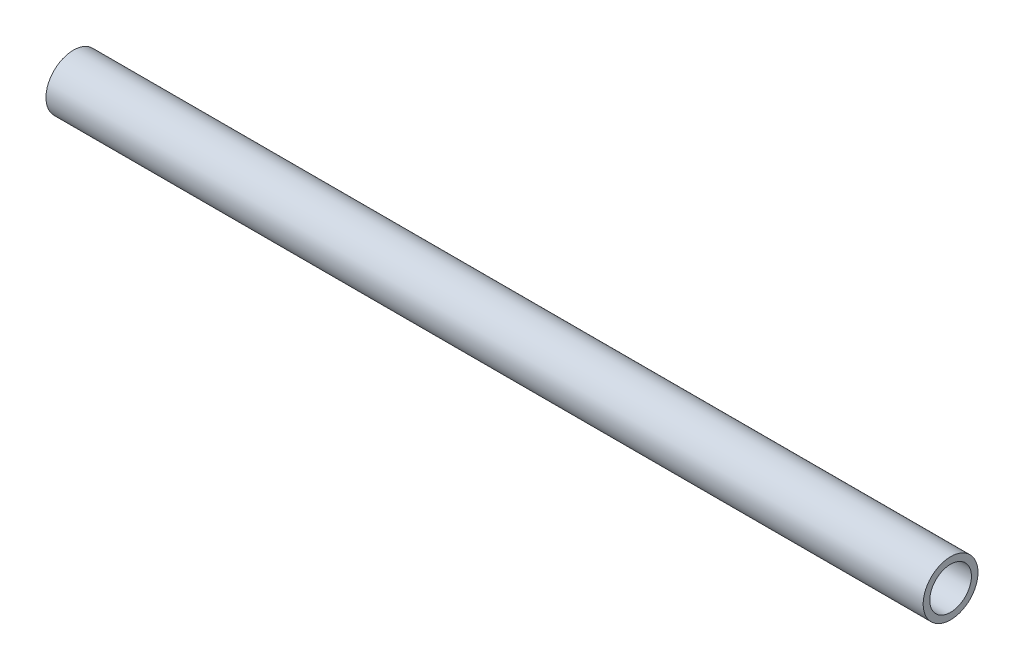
ISO-10303-21;
HEADER;
FILE_DESCRIPTION(('STEP AP214'),'2;1');
FILE_NAME('part.step','',(''),(''),'','','');
FILE_SCHEMA(('AUTOMOTIVE_DESIGN { 1 0 10303 214 1 1 1 1 }'));
ENDSEC;
DATA;
#1=APPLICATION_CONTEXT('core data for automotive mechanical design processes');
#2=APPLICATION_PROTOCOL_DEFINITION('international standard','automotive_design',2000,#1);
#3=PRODUCT_CONTEXT('',#1,'mechanical');
#4=PRODUCT('Part','Part','',(#3));
#5=PRODUCT_RELATED_PRODUCT_CATEGORY('part','',(#4));
#6=PRODUCT_DEFINITION_FORMATION('','',#4);
#7=PRODUCT_DEFINITION_CONTEXT('part definition',#1,'design');
#8=PRODUCT_DEFINITION('design','',#6,#7);
#9=PRODUCT_DEFINITION_SHAPE('','',#8);
#10=(LENGTH_UNIT() NAMED_UNIT(*) SI_UNIT(.MILLI.,.METRE.));
#11=(NAMED_UNIT(*) PLANE_ANGLE_UNIT() SI_UNIT($,.RADIAN.));
#12=(NAMED_UNIT(*) SI_UNIT($,.STERADIAN.) SOLID_ANGLE_UNIT());
#13=UNCERTAINTY_MEASURE_WITH_UNIT(LENGTH_MEASURE(1.E-05),#10,'distance_accuracy_value','');
#14=(GEOMETRIC_REPRESENTATION_CONTEXT(3) GLOBAL_UNCERTAINTY_ASSIGNED_CONTEXT((#13)) GLOBAL_UNIT_ASSIGNED_CONTEXT((#10,
#11,#12)) REPRESENTATION_CONTEXT('',''));
#15=CARTESIAN_POINT('',(0.,0.,0.));
#16=DIRECTION('',(0.,0.,1.));
#17=DIRECTION('',(1.,0.,0.));
#18=AXIS2_PLACEMENT_3D('',#15,#16,#17);
#19=CARTESIAN_POINT('',(400.,0.,0.));
#20=DIRECTION('',(-1.,0.,0.));
#21=DIRECTION('',(0.,0.,1.));
#22=AXIS2_PLACEMENT_3D('',#19,#20,#21);
#23=CYLINDRICAL_SURFACE('',#22,9.5);
#24=CARTESIAN_POINT('',(400.,0.,0.));
#25=DIRECTION('',(1.,0.,0.));
#26=DIRECTION('',(0.,0.,-1.));
#27=AXIS2_PLACEMENT_3D('',#24,#25,#26);
#28=CIRCLE('',#27,9.5);
#29=CARTESIAN_POINT('',(400.,0.,-9.5));
#30=VERTEX_POINT('',#29);
#31=EDGE_CURVE('E58',#30,#30,#28,.T.);
#32=ORIENTED_EDGE('',*,*,#31,.T.);
#33=EDGE_LOOP('',(#32));
#34=FACE_BOUND('',#33,.T.);
#35=CARTESIAN_POINT('',(0.,0.,0.));
#36=DIRECTION('',(1.,0.,0.));
#37=DIRECTION('',(0.,0.,-1.));
#38=AXIS2_PLACEMENT_3D('',#35,#36,#37);
#39=CIRCLE('',#38,9.5);
#40=CARTESIAN_POINT('',(0.,0.,-9.5));
#41=VERTEX_POINT('',#40);
#42=EDGE_CURVE('E65',#41,#41,#39,.T.);
#43=ORIENTED_EDGE('',*,*,#42,.F.);
#44=EDGE_LOOP('',(#43));
#45=FACE_BOUND('',#44,.T.);
#46=ADVANCED_FACE('F50',(#34,#45),#23,.F.);
#47=CARTESIAN_POINT('',(400.,0.,0.));
#48=DIRECTION('',(-1.,0.,0.));
#49=DIRECTION('',(0.,0.,1.));
#50=AXIS2_PLACEMENT_3D('',#47,#48,#49);
#51=CYLINDRICAL_SURFACE('',#50,12.5);
#52=CARTESIAN_POINT('',(400.,0.,0.));
#53=DIRECTION('',(1.,0.,0.));
#54=DIRECTION('',(0.,0.,-1.));
#55=AXIS2_PLACEMENT_3D('',#52,#53,#54);
#56=CIRCLE('',#55,12.5);
#57=CARTESIAN_POINT('',(400.,0.,-12.5));
#58=VERTEX_POINT('',#57);
#59=EDGE_CURVE('E11',#58,#58,#56,.T.);
#60=ORIENTED_EDGE('',*,*,#59,.F.);
#61=EDGE_LOOP('',(#60));
#62=FACE_BOUND('',#61,.T.);
#63=CARTESIAN_POINT('',(0.,0.,0.));
#64=DIRECTION('',(1.,0.,0.));
#65=DIRECTION('',(0.,0.,-1.));
#66=AXIS2_PLACEMENT_3D('',#63,#64,#65);
#67=CIRCLE('',#66,12.5);
#68=CARTESIAN_POINT('',(0.,0.,-12.5));
#69=VERTEX_POINT('',#68);
#70=EDGE_CURVE('E53',#69,#69,#67,.T.);
#71=ORIENTED_EDGE('',*,*,#70,.T.);
#72=EDGE_LOOP('',(#71));
#73=FACE_BOUND('',#72,.T.);
#74=ADVANCED_FACE('F74',(#62,#73),#51,.T.);
#75=CARTESIAN_POINT('',(400.,0.,0.));
#76=DIRECTION('',(1.,0.,0.));
#77=DIRECTION('',(0.,0.,-1.));
#78=AXIS2_PLACEMENT_3D('',#75,#76,#77);
#79=PLANE('',#78);
#80=ORIENTED_EDGE('',*,*,#31,.F.);
#81=EDGE_LOOP('',(#80));
#82=FACE_BOUND('',#81,.T.);
#83=ORIENTED_EDGE('',*,*,#59,.T.);
#84=EDGE_LOOP('',(#83));
#85=FACE_BOUND('',#84,.T.);
#86=ADVANCED_FACE('F78',(#82,#85),#79,.T.);
#87=CARTESIAN_POINT('',(0.,0.,0.));
#88=DIRECTION('',(1.,0.,0.));
#89=DIRECTION('',(0.,0.,-1.));
#90=AXIS2_PLACEMENT_3D('',#87,#88,#89);
#91=PLANE('',#90);
#92=ORIENTED_EDGE('',*,*,#42,.T.);
#93=EDGE_LOOP('',(#92));
#94=FACE_BOUND('',#93,.T.);
#95=ORIENTED_EDGE('',*,*,#70,.F.);
#96=EDGE_LOOP('',(#95));
#97=FACE_BOUND('',#96,.T.);
#98=ADVANCED_FACE('F76',(#94,#97),#91,.F.);
#99=CLOSED_SHELL('',(#46,#74,#86,#98));
#100=MANIFOLD_SOLID_BREP('B2',#99);
#101=ADVANCED_BREP_SHAPE_REPRESENTATION('',(#18,#100),#14);
#102=SHAPE_DEFINITION_REPRESENTATION(#9,#101);
ENDSEC;
END-ISO-10303-21;
